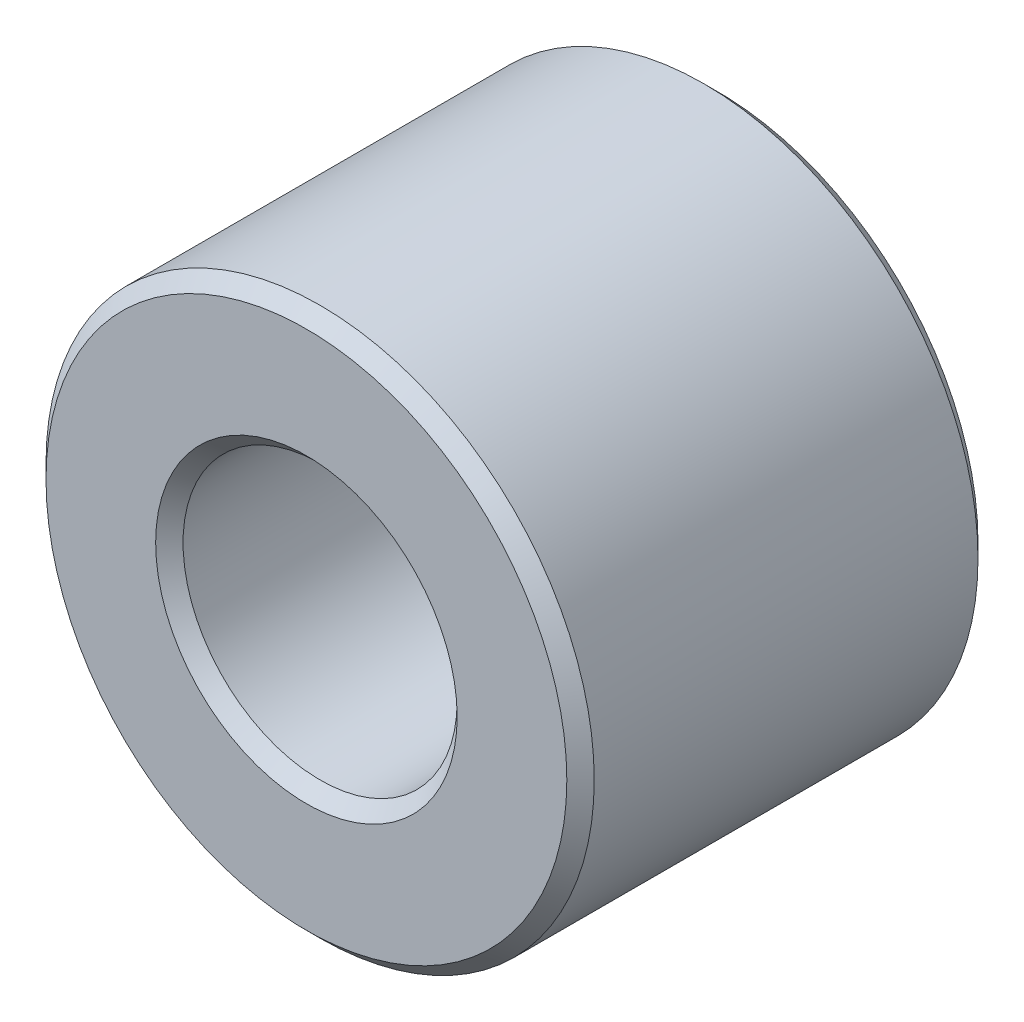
ISO-10303-21;
HEADER;
FILE_DESCRIPTION(('STEP AP214'),'2;1');
FILE_NAME('part.step','',(''),(''),'','','');
FILE_SCHEMA(('AUTOMOTIVE_DESIGN { 1 0 10303 214 1 1 1 1 }'));
ENDSEC;
DATA;
#1=APPLICATION_CONTEXT('core data for automotive mechanical design processes');
#2=APPLICATION_PROTOCOL_DEFINITION('international standard','automotive_design',2000,#1);
#3=PRODUCT_CONTEXT('',#1,'mechanical');
#4=PRODUCT('Part','Part','',(#3));
#5=PRODUCT_RELATED_PRODUCT_CATEGORY('part','',(#4));
#6=PRODUCT_DEFINITION_FORMATION('','',#4);
#7=PRODUCT_DEFINITION_CONTEXT('part definition',#1,'design');
#8=PRODUCT_DEFINITION('design','',#6,#7);
#9=PRODUCT_DEFINITION_SHAPE('','',#8);
#10=(LENGTH_UNIT() NAMED_UNIT(*) SI_UNIT(.MILLI.,.METRE.));
#11=(NAMED_UNIT(*) PLANE_ANGLE_UNIT() SI_UNIT($,.RADIAN.));
#12=(NAMED_UNIT(*) SI_UNIT($,.STERADIAN.) SOLID_ANGLE_UNIT());
#13=UNCERTAINTY_MEASURE_WITH_UNIT(LENGTH_MEASURE(1.E-05),#10,'distance_accuracy_value','');
#14=(GEOMETRIC_REPRESENTATION_CONTEXT(3) GLOBAL_UNCERTAINTY_ASSIGNED_CONTEXT((#13)) GLOBAL_UNIT_ASSIGNED_CONTEXT((#10,
#11,#12)) REPRESENTATION_CONTEXT('',''));
#15=CARTESIAN_POINT('',(0.,0.,0.));
#16=DIRECTION('',(0.,0.,1.));
#17=DIRECTION('',(1.,0.,0.));
#18=AXIS2_PLACEMENT_3D('',#15,#16,#17);
#19=CARTESIAN_POINT('',(0.,0.,30.));
#20=DIRECTION('',(0.,0.,1.));
#21=DIRECTION('',(1.,0.,0.));
#22=AXIS2_PLACEMENT_3D('',#19,#20,#21);
#23=PLANE('',#22);
#24=CARTESIAN_POINT('',(0.,0.,30.));
#25=DIRECTION('',(0.,0.,1.));
#26=DIRECTION('',(1.,0.,0.));
#27=AXIS2_PLACEMENT_3D('',#24,#25,#26);
#28=CIRCLE('',#27,22.);
#29=CARTESIAN_POINT('',(22.,0.,30.));
#30=VERTEX_POINT('',#29);
#31=EDGE_CURVE('E10',#30,#30,#28,.F.);
#32=ORIENTED_EDGE('',*,*,#31,.T.);
#33=EDGE_LOOP('',(#32));
#34=FACE_BOUND('',#33,.T.);
#35=CARTESIAN_POINT('',(0.,0.,30.));
#36=DIRECTION('',(0.,0.,1.));
#37=DIRECTION('',(1.,0.,0.));
#38=AXIS2_PLACEMENT_3D('',#35,#36,#37);
#39=CIRCLE('',#38,38.);
#40=CARTESIAN_POINT('',(38.,0.,30.));
#41=VERTEX_POINT('',#40);
#42=EDGE_CURVE('E45',#41,#41,#39,.T.);
#43=ORIENTED_EDGE('',*,*,#42,.T.);
#44=EDGE_LOOP('',(#43));
#45=FACE_BOUND('',#44,.T.);
#46=ADVANCED_FACE('F37',(#34,#45),#23,.T.);
#47=CARTESIAN_POINT('',(0.,0.,-30.));
#48=DIRECTION('',(0.,0.,1.));
#49=DIRECTION('',(1.,0.,0.));
#50=AXIS2_PLACEMENT_3D('',#47,#48,#49);
#51=PLANE('',#50);
#52=CARTESIAN_POINT('',(0.,0.,-30.));
#53=DIRECTION('',(0.,0.,1.));
#54=DIRECTION('',(1.,0.,0.));
#55=AXIS2_PLACEMENT_3D('',#52,#53,#54);
#56=CIRCLE('',#55,22.);
#57=CARTESIAN_POINT('',(22.,0.,-30.));
#58=VERTEX_POINT('',#57);
#59=EDGE_CURVE('E70',#58,#58,#56,.T.);
#60=ORIENTED_EDGE('',*,*,#59,.T.);
#61=EDGE_LOOP('',(#60));
#62=FACE_BOUND('',#61,.T.);
#63=CARTESIAN_POINT('',(0.,0.,-30.));
#64=DIRECTION('',(0.,0.,1.));
#65=DIRECTION('',(1.,0.,0.));
#66=AXIS2_PLACEMENT_3D('',#63,#64,#65);
#67=CIRCLE('',#66,38.);
#68=CARTESIAN_POINT('',(38.,0.,-30.));
#69=VERTEX_POINT('',#68);
#70=EDGE_CURVE('E73',#69,#69,#67,.F.);
#71=ORIENTED_EDGE('',*,*,#70,.T.);
#72=EDGE_LOOP('',(#71));
#73=FACE_BOUND('',#72,.T.);
#74=ADVANCED_FACE('F78',(#62,#73),#51,.F.);
#75=CARTESIAN_POINT('',(0.,0.,30.));
#76=DIRECTION('',(0.,0.,-1.));
#77=DIRECTION('',(-1.,0.,0.));
#78=AXIS2_PLACEMENT_3D('',#75,#76,#77);
#79=CYLINDRICAL_SURFACE('',#78,40.);
#80=CARTESIAN_POINT('',(0.,0.,-28.));
#81=DIRECTION('',(0.,0.,1.));
#82=DIRECTION('',(1.,0.,0.));
#83=AXIS2_PLACEMENT_3D('',#80,#81,#82);
#84=CIRCLE('',#83,40.);
#85=CARTESIAN_POINT('',(40.,0.,-28.));
#86=VERTEX_POINT('',#85);
#87=EDGE_CURVE('E51',#86,#86,#84,.T.);
#88=ORIENTED_EDGE('',*,*,#87,.T.);
#89=EDGE_LOOP('',(#88));
#90=FACE_BOUND('',#89,.T.);
#91=CARTESIAN_POINT('',(0.,0.,28.));
#92=DIRECTION('',(0.,0.,1.));
#93=DIRECTION('',(1.,0.,0.));
#94=AXIS2_PLACEMENT_3D('',#91,#92,#93);
#95=CIRCLE('',#94,40.);
#96=CARTESIAN_POINT('',(40.,0.,28.));
#97=VERTEX_POINT('',#96);
#98=EDGE_CURVE('E56',#97,#97,#95,.F.);
#99=ORIENTED_EDGE('',*,*,#98,.T.);
#100=EDGE_LOOP('',(#99));
#101=FACE_BOUND('',#100,.T.);
#102=ADVANCED_FACE('F88',(#90,#101),#79,.T.);
#103=CARTESIAN_POINT('',(0.,0.,30.));
#104=DIRECTION('',(0.,0.,-1.));
#105=DIRECTION('',(-1.,0.,0.));
#106=AXIS2_PLACEMENT_3D('',#103,#104,#105);
#107=CYLINDRICAL_SURFACE('',#106,20.);
#108=CARTESIAN_POINT('',(0.,0.,-28.));
#109=DIRECTION('',(0.,0.,1.));
#110=DIRECTION('',(1.,0.,0.));
#111=AXIS2_PLACEMENT_3D('',#108,#109,#110);
#112=CIRCLE('',#111,20.);
#113=CARTESIAN_POINT('',(20.,0.,-28.));
#114=VERTEX_POINT('',#113);
#115=EDGE_CURVE('E62',#114,#114,#112,.F.);
#116=ORIENTED_EDGE('',*,*,#115,.T.);
#117=EDGE_LOOP('',(#116));
#118=FACE_BOUND('',#117,.T.);
#119=CARTESIAN_POINT('',(0.,0.,28.));
#120=DIRECTION('',(0.,0.,1.));
#121=DIRECTION('',(1.,0.,0.));
#122=AXIS2_PLACEMENT_3D('',#119,#120,#121);
#123=CIRCLE('',#122,20.);
#124=CARTESIAN_POINT('',(20.,0.,28.));
#125=VERTEX_POINT('',#124);
#126=EDGE_CURVE('E66',#125,#125,#123,.T.);
#127=ORIENTED_EDGE('',*,*,#126,.T.);
#128=EDGE_LOOP('',(#127));
#129=FACE_BOUND('',#128,.T.);
#130=ADVANCED_FACE('F91',(#118,#129),#107,.F.);
#131=CARTESIAN_POINT('',(0.,0.,-30.));
#132=DIRECTION('',(0.,0.,-1.));
#133=DIRECTION('',(-1.,0.,0.));
#134=AXIS2_PLACEMENT_3D('',#131,#132,#133);
#135=CONICAL_SURFACE('',#134,22.,0.785398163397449);
#136=ORIENTED_EDGE('',*,*,#115,.F.);
#137=EDGE_LOOP('',(#136));
#138=FACE_BOUND('',#137,.T.);
#139=ORIENTED_EDGE('',*,*,#59,.F.);
#140=EDGE_LOOP('',(#139));
#141=FACE_BOUND('',#140,.T.);
#142=ADVANCED_FACE('F84',(#138,#141),#135,.F.);
#143=CARTESIAN_POINT('',(0.,0.,-28.));
#144=DIRECTION('',(0.,0.,1.));
#145=DIRECTION('',(1.,0.,0.));
#146=AXIS2_PLACEMENT_3D('',#143,#144,#145);
#147=CONICAL_SURFACE('',#146,40.,0.785398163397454);
#148=ORIENTED_EDGE('',*,*,#70,.F.);
#149=EDGE_LOOP('',(#148));
#150=FACE_BOUND('',#149,.T.);
#151=ORIENTED_EDGE('',*,*,#87,.F.);
#152=EDGE_LOOP('',(#151));
#153=FACE_BOUND('',#152,.T.);
#154=ADVANCED_FACE('F80',(#150,#153),#147,.T.);
#155=CARTESIAN_POINT('',(0.,0.,28.));
#156=DIRECTION('',(0.,0.,1.));
#157=DIRECTION('',(1.,0.,0.));
#158=AXIS2_PLACEMENT_3D('',#155,#156,#157);
#159=CONICAL_SURFACE('',#158,20.,0.785398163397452);
#160=ORIENTED_EDGE('',*,*,#31,.F.);
#161=EDGE_LOOP('',(#160));
#162=FACE_BOUND('',#161,.T.);
#163=ORIENTED_EDGE('',*,*,#126,.F.);
#164=EDGE_LOOP('',(#163));
#165=FACE_BOUND('',#164,.T.);
#166=ADVANCED_FACE('F83',(#162,#165),#159,.F.);
#167=CARTESIAN_POINT('',(0.,0.,30.));
#168=DIRECTION('',(0.,0.,-1.));
#169=DIRECTION('',(-1.,0.,0.));
#170=AXIS2_PLACEMENT_3D('',#167,#168,#169);
#171=CONICAL_SURFACE('',#170,38.,0.785398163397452);
#172=ORIENTED_EDGE('',*,*,#98,.F.);
#173=EDGE_LOOP('',(#172));
#174=FACE_BOUND('',#173,.T.);
#175=ORIENTED_EDGE('',*,*,#42,.F.);
#176=EDGE_LOOP('',(#175));
#177=FACE_BOUND('',#176,.T.);
#178=ADVANCED_FACE('F39',(#174,#177),#171,.T.);
#179=CLOSED_SHELL('',(#46,#74,#102,#130,#142,#154,#166,#178));
#180=MANIFOLD_SOLID_BREP('B2',#179);
#181=ADVANCED_BREP_SHAPE_REPRESENTATION('',(#18,#180),#14);
#182=SHAPE_DEFINITION_REPRESENTATION(#9,#181);
ENDSEC;
END-ISO-10303-21;
